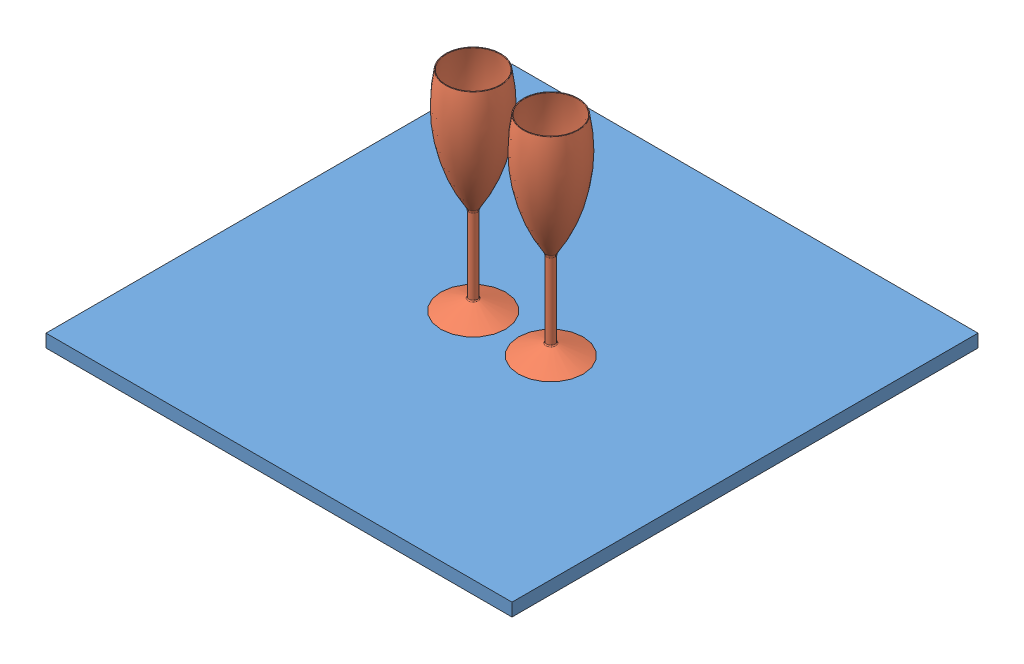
SolidWorks assembly Champagne Glasses.SLDASM, configuration Default (file format 3100). Lengths in mm.
Overall size (457.2 218.23 457.2).
3 component instances, 2 part files, 6 mates.
Components (placement in the parent):
- Counter-1: Counter.SLDPRT [Default] at (124.2699 -153.7162 38.857) size (457.2 12.7 457.2)
- Champagne Glasses For Caustics-2: Champagne Glasses For Caustics.SLDPRT [Default] at (162.3699 -153.7162 38.857) size (63.5 205.53 63.5)
- Champagne Glasses For Caustics-3: Champagne Glasses For Caustics.SLDPRT [Default] at (86.1699 -153.7162 38.857) size (63.5 205.53 63.5)
Mates (geometry in assembly coordinates):
- Coincident1: coincident aligned: plane of Counter-1 through (-104.3301 -153.7162 267.457) normal (0 1 0); circle of Champagne Glasses For Caustics-2 centre (162.3699 -153.7162 38.857) axis (0 1 0)
- Coincident2: coincident anti-aligned: plane of Counter-1 through (-104.3301 -153.7162 267.457) normal (0 1 0); plane of Champagne Glasses For Caustics-3 through (86.1699 -153.7162 38.857) normal (0 -1 0)
- Distance1: distance = 190.5 mm: line of Counter-1; line of Champagne Glasses For Caustics-2
- Distance2: distance = 190.5 mm: line of Counter-1; line of Champagne Glasses For Caustics-3
- Distance3: distance = 228.6 mm: line of Counter-1; line of Champagne Glasses For Caustics-2
- Distance4: distance = 228.6 mm: line of Counter-1; line of Champagne Glasses For Caustics-3
